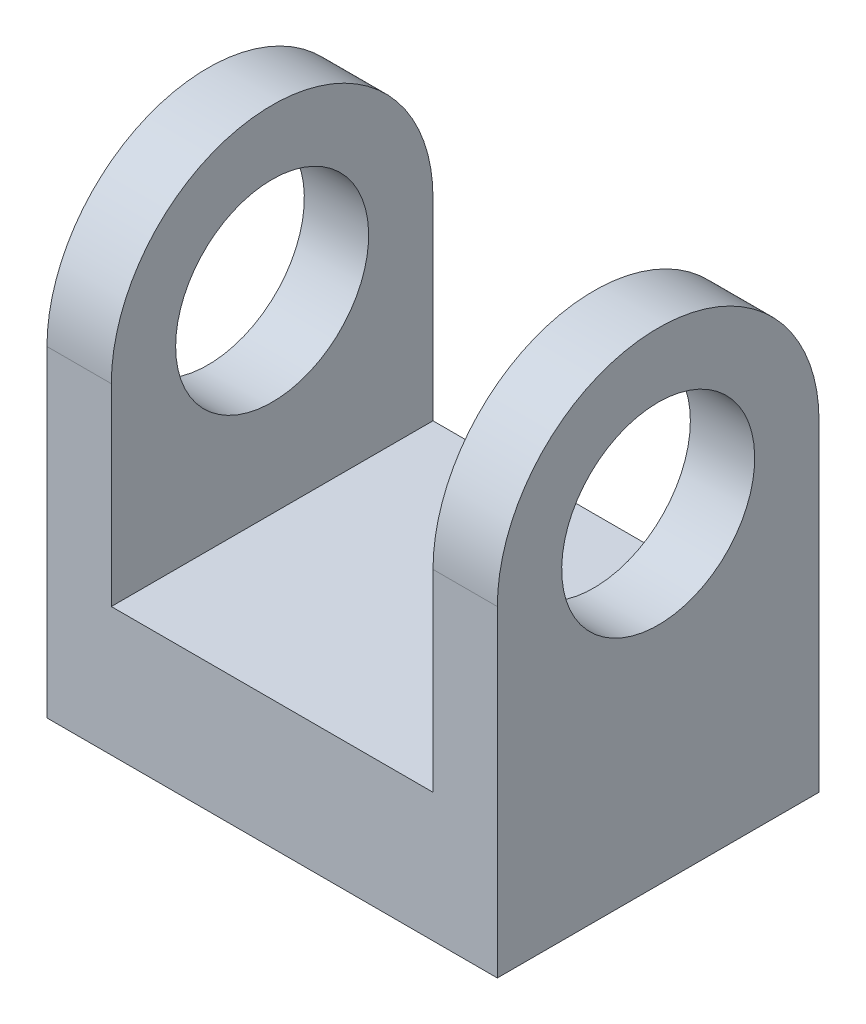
ISO-10303-21;
HEADER;
FILE_DESCRIPTION(('STEP AP214'),'2;1');
FILE_NAME('part.step','',(''),(''),'','','');
FILE_SCHEMA(('AUTOMOTIVE_DESIGN { 1 0 10303 214 1 1 1 1 }'));
ENDSEC;
DATA;
#1=APPLICATION_CONTEXT('core data for automotive mechanical design processes');
#2=APPLICATION_PROTOCOL_DEFINITION('international standard','automotive_design',2000,#1);
#3=PRODUCT_CONTEXT('',#1,'mechanical');
#4=PRODUCT('Part','Part','',(#3));
#5=PRODUCT_RELATED_PRODUCT_CATEGORY('part','',(#4));
#6=PRODUCT_DEFINITION_FORMATION('','',#4);
#7=PRODUCT_DEFINITION_CONTEXT('part definition',#1,'design');
#8=PRODUCT_DEFINITION('design','',#6,#7);
#9=PRODUCT_DEFINITION_SHAPE('','',#8);
#10=(LENGTH_UNIT() NAMED_UNIT(*) SI_UNIT(.MILLI.,.METRE.));
#11=(NAMED_UNIT(*) PLANE_ANGLE_UNIT() SI_UNIT($,.RADIAN.));
#12=(NAMED_UNIT(*) SI_UNIT($,.STERADIAN.) SOLID_ANGLE_UNIT());
#13=UNCERTAINTY_MEASURE_WITH_UNIT(LENGTH_MEASURE(1.E-05),#10,'distance_accuracy_value','');
#14=(GEOMETRIC_REPRESENTATION_CONTEXT(3) GLOBAL_UNCERTAINTY_ASSIGNED_CONTEXT((#13)) GLOBAL_UNIT_ASSIGNED_CONTEXT((#10,
#11,#12)) REPRESENTATION_CONTEXT('',''));
#15=CARTESIAN_POINT('',(0.,0.,0.));
#16=DIRECTION('',(0.,0.,1.));
#17=DIRECTION('',(1.,0.,0.));
#18=AXIS2_PLACEMENT_3D('',#15,#16,#17);
#19=CARTESIAN_POINT('',(-25.,30.,0.));
#20=DIRECTION('',(-1.,0.,0.));
#21=DIRECTION('',(0.,0.,1.));
#22=AXIS2_PLACEMENT_3D('',#19,#20,#21);
#23=CYLINDRICAL_SURFACE('',#22,25.);
#24=DIRECTION('',(-1.,0.,0.));
#25=VECTOR('',#24,1.);
#26=CARTESIAN_POINT('',(-25.,30.,25.));
#27=LINE('',#26,#25);
#28=CARTESIAN_POINT('',(-25.,30.,25.));
#29=VERTEX_POINT('',#28);
#30=CARTESIAN_POINT('',(-35.,30.,25.));
#31=VERTEX_POINT('',#30);
#32=EDGE_CURVE('E160',#29,#31,#27,.T.);
#33=ORIENTED_EDGE('',*,*,#32,.F.);
#34=CARTESIAN_POINT('',(-25.,30.,0.));
#35=DIRECTION('',(-1.,0.,0.));
#36=DIRECTION('',(0.,0.,1.));
#37=AXIS2_PLACEMENT_3D('',#34,#35,#36);
#38=CIRCLE('',#37,25.);
#39=CARTESIAN_POINT('',(-25.,30.,-25.));
#40=VERTEX_POINT('',#39);
#41=EDGE_CURVE('E41',#40,#29,#38,.F.);
#42=ORIENTED_EDGE('',*,*,#41,.F.);
#43=DIRECTION('',(1.,0.,0.));
#44=VECTOR('',#43,1.);
#45=CARTESIAN_POINT('',(-25.,30.,-25.));
#46=LINE('',#45,#44);
#47=CARTESIAN_POINT('',(-35.,30.,-25.));
#48=VERTEX_POINT('',#47);
#49=EDGE_CURVE('E120',#48,#40,#46,.T.);
#50=ORIENTED_EDGE('',*,*,#49,.F.);
#51=CARTESIAN_POINT('',(-35.,30.,0.));
#52=DIRECTION('',(1.,0.,0.));
#53=DIRECTION('',(0.,1.,0.));
#54=AXIS2_PLACEMENT_3D('',#51,#52,#53);
#55=CIRCLE('',#54,25.);
#56=EDGE_CURVE('E11',#31,#48,#55,.F.);
#57=ORIENTED_EDGE('',*,*,#56,.F.);
#58=EDGE_LOOP('',(#33,#42,#50,#57));
#59=FACE_BOUND('',#58,.T.);
#60=ADVANCED_FACE('F33',(#59),#23,.T.);
#61=CARTESIAN_POINT('',(35.,30.,0.));
#62=DIRECTION('',(-1.,0.,0.));
#63=DIRECTION('',(0.,0.,1.));
#64=AXIS2_PLACEMENT_3D('',#61,#62,#63);
#65=CYLINDRICAL_SURFACE('',#64,25.);
#66=DIRECTION('',(-1.,0.,0.));
#67=VECTOR('',#66,1.);
#68=CARTESIAN_POINT('',(-25.,30.,25.));
#69=LINE('',#68,#67);
#70=CARTESIAN_POINT('',(35.,30.,25.));
#71=VERTEX_POINT('',#70);
#72=CARTESIAN_POINT('',(25.,30.,25.));
#73=VERTEX_POINT('',#72);
#74=EDGE_CURVE('E115',#71,#73,#69,.T.);
#75=ORIENTED_EDGE('',*,*,#74,.F.);
#76=CARTESIAN_POINT('',(35.,30.,0.));
#77=DIRECTION('',(-1.,0.,0.));
#78=DIRECTION('',(0.,-1.,0.));
#79=AXIS2_PLACEMENT_3D('',#76,#77,#78);
#80=CIRCLE('',#79,25.);
#81=CARTESIAN_POINT('',(35.,30.,-25.));
#82=VERTEX_POINT('',#81);
#83=EDGE_CURVE('E156',#82,#71,#80,.F.);
#84=ORIENTED_EDGE('',*,*,#83,.F.);
#85=DIRECTION('',(1.,0.,0.));
#86=VECTOR('',#85,1.);
#87=CARTESIAN_POINT('',(35.,30.,-25.));
#88=LINE('',#87,#86);
#89=CARTESIAN_POINT('',(25.,30.,-25.));
#90=VERTEX_POINT('',#89);
#91=EDGE_CURVE('E153',#90,#82,#88,.T.);
#92=ORIENTED_EDGE('',*,*,#91,.F.);
#93=CARTESIAN_POINT('',(25.,30.,0.));
#94=DIRECTION('',(1.,0.,0.));
#95=DIRECTION('',(0.,0.,-1.));
#96=AXIS2_PLACEMENT_3D('',#93,#94,#95);
#97=CIRCLE('',#96,25.);
#98=EDGE_CURVE('E158',#73,#90,#97,.F.);
#99=ORIENTED_EDGE('',*,*,#98,.F.);
#100=EDGE_LOOP('',(#75,#84,#92,#99));
#101=FACE_BOUND('',#100,.T.);
#102=ADVANCED_FACE('F195',(#101),#65,.T.);
#103=CARTESIAN_POINT('',(-25.,0.,25.));
#104=DIRECTION('',(0.,-1.,0.));
#105=DIRECTION('',(0.,0.,-1.));
#106=AXIS2_PLACEMENT_3D('',#103,#104,#105);
#107=PLANE('',#106);
#108=DIRECTION('',(-1.,0.,0.));
#109=VECTOR('',#108,1.);
#110=CARTESIAN_POINT('',(-25.,0.,-25.));
#111=LINE('',#110,#109);
#112=CARTESIAN_POINT('',(25.,0.,-25.));
#113=VERTEX_POINT('',#112);
#114=CARTESIAN_POINT('',(-25.,0.,-25.));
#115=VERTEX_POINT('',#114);
#116=EDGE_CURVE('E96',#113,#115,#111,.T.);
#117=ORIENTED_EDGE('',*,*,#116,.T.);
#118=DIRECTION('',(0.,0.,-1.));
#119=VECTOR('',#118,1.);
#120=CARTESIAN_POINT('',(-25.,0.,25.));
#121=LINE('',#120,#119);
#122=CARTESIAN_POINT('',(-25.,0.,25.));
#123=VERTEX_POINT('',#122);
#124=EDGE_CURVE('E100',#123,#115,#121,.T.);
#125=ORIENTED_EDGE('',*,*,#124,.F.);
#126=DIRECTION('',(-1.,0.,0.));
#127=VECTOR('',#126,1.);
#128=CARTESIAN_POINT('',(25.,0.,25.));
#129=LINE('',#128,#127);
#130=CARTESIAN_POINT('',(25.,0.,25.));
#131=VERTEX_POINT('',#130);
#132=EDGE_CURVE('E133',#131,#123,#129,.T.);
#133=ORIENTED_EDGE('',*,*,#132,.F.);
#134=DIRECTION('',(0.,0.,-1.));
#135=VECTOR('',#134,1.);
#136=CARTESIAN_POINT('',(25.,0.,25.));
#137=LINE('',#136,#135);
#138=EDGE_CURVE('E103',#131,#113,#137,.T.);
#139=ORIENTED_EDGE('',*,*,#138,.T.);
#140=EDGE_LOOP('',(#117,#125,#133,#139));
#141=FACE_BOUND('',#140,.T.);
#142=ADVANCED_FACE('F98',(#141),#107,.F.);
#143=CARTESIAN_POINT('',(-25.,0.,25.));
#144=DIRECTION('',(-1.,0.,0.));
#145=DIRECTION('',(0.,0.,1.));
#146=AXIS2_PLACEMENT_3D('',#143,#144,#145);
#147=PLANE('',#146);
#148=CARTESIAN_POINT('',(-25.,30.,0.));
#149=DIRECTION('',(-1.,0.,0.));
#150=DIRECTION('',(0.,0.,1.));
#151=AXIS2_PLACEMENT_3D('',#148,#149,#150);
#152=CIRCLE('',#151,15.);
#153=CARTESIAN_POINT('',(-25.,30.,15.));
#154=VERTEX_POINT('',#153);
#155=EDGE_CURVE('E108',#154,#154,#152,.T.);
#156=ORIENTED_EDGE('',*,*,#155,.T.);
#157=EDGE_LOOP('',(#156));
#158=FACE_BOUND('',#157,.T.);
#159=DIRECTION('',(0.,1.,0.));
#160=VECTOR('',#159,1.);
#161=CARTESIAN_POINT('',(-25.,0.,-25.));
#162=LINE('',#161,#160);
#163=EDGE_CURVE('E107',#115,#40,#162,.T.);
#164=ORIENTED_EDGE('',*,*,#163,.T.);
#165=ORIENTED_EDGE('',*,*,#41,.T.);
#166=DIRECTION('',(0.,1.,0.));
#167=VECTOR('',#166,1.);
#168=CARTESIAN_POINT('',(-25.,0.,25.));
#169=LINE('',#168,#167);
#170=EDGE_CURVE('E114',#123,#29,#169,.T.);
#171=ORIENTED_EDGE('',*,*,#170,.F.);
#172=ORIENTED_EDGE('',*,*,#124,.T.);
#173=EDGE_LOOP('',(#164,#165,#171,#172));
#174=FACE_BOUND('',#173,.T.);
#175=ADVANCED_FACE('F112',(#158,#174),#147,.F.);
#176=CARTESIAN_POINT('',(-35.,55.,25.));
#177=DIRECTION('',(1.,0.,0.));
#178=DIRECTION('',(0.,1.,0.));
#179=AXIS2_PLACEMENT_3D('',#176,#177,#178);
#180=PLANE('',#179);
#181=CARTESIAN_POINT('',(-35.,30.,0.));
#182=DIRECTION('',(1.,0.,0.));
#183=DIRECTION('',(0.,1.,0.));
#184=AXIS2_PLACEMENT_3D('',#181,#182,#183);
#185=CIRCLE('',#184,15.);
#186=CARTESIAN_POINT('',(-35.,45.,0.));
#187=VERTEX_POINT('',#186);
#188=EDGE_CURVE('E286',#187,#187,#185,.T.);
#189=ORIENTED_EDGE('',*,*,#188,.T.);
#190=EDGE_LOOP('',(#189));
#191=FACE_BOUND('',#190,.T.);
#192=DIRECTION('',(0.,-1.,0.));
#193=VECTOR('',#192,1.);
#194=CARTESIAN_POINT('',(-35.,55.,25.));
#195=LINE('',#194,#193);
#196=CARTESIAN_POINT('',(-35.,-20.,25.));
#197=VERTEX_POINT('',#196);
#198=EDGE_CURVE('E136',#31,#197,#195,.T.);
#199=ORIENTED_EDGE('',*,*,#198,.F.);
#200=ORIENTED_EDGE('',*,*,#56,.T.);
#201=DIRECTION('',(0.,-1.,0.));
#202=VECTOR('',#201,1.);
#203=CARTESIAN_POINT('',(-35.,55.,-25.));
#204=LINE('',#203,#202);
#205=CARTESIAN_POINT('',(-35.,-20.,-25.));
#206=VERTEX_POINT('',#205);
#207=EDGE_CURVE('E121',#48,#206,#204,.T.);
#208=ORIENTED_EDGE('',*,*,#207,.T.);
#209=DIRECTION('',(0.,0.,-1.));
#210=VECTOR('',#209,1.);
#211=CARTESIAN_POINT('',(-35.,-20.,25.));
#212=LINE('',#211,#210);
#213=EDGE_CURVE('E116',#197,#206,#212,.T.);
#214=ORIENTED_EDGE('',*,*,#213,.F.);
#215=EDGE_LOOP('',(#199,#200,#208,#214));
#216=FACE_BOUND('',#215,.T.);
#217=ADVANCED_FACE('F182',(#191,#216),#180,.F.);
#218=CARTESIAN_POINT('',(35.,-20.,25.));
#219=DIRECTION('',(0.,1.,0.));
#220=DIRECTION('',(0.,0.,1.));
#221=AXIS2_PLACEMENT_3D('',#218,#219,#220);
#222=PLANE('',#221);
#223=DIRECTION('',(1.,0.,0.));
#224=VECTOR('',#223,1.);
#225=CARTESIAN_POINT('',(35.,-20.,-25.));
#226=LINE('',#225,#224);
#227=CARTESIAN_POINT('',(35.,-20.,-25.));
#228=VERTEX_POINT('',#227);
#229=EDGE_CURVE('E123',#206,#228,#226,.T.);
#230=ORIENTED_EDGE('',*,*,#229,.T.);
#231=DIRECTION('',(0.,0.,-1.));
#232=VECTOR('',#231,1.);
#233=CARTESIAN_POINT('',(35.,-20.,25.));
#234=LINE('',#233,#232);
#235=CARTESIAN_POINT('',(35.,-20.,25.));
#236=VERTEX_POINT('',#235);
#237=EDGE_CURVE('E146',#236,#228,#234,.T.);
#238=ORIENTED_EDGE('',*,*,#237,.F.);
#239=DIRECTION('',(1.,0.,0.));
#240=VECTOR('',#239,1.);
#241=CARTESIAN_POINT('',(35.,-20.,25.));
#242=LINE('',#241,#240);
#243=EDGE_CURVE('E138',#197,#236,#242,.T.);
#244=ORIENTED_EDGE('',*,*,#243,.F.);
#245=ORIENTED_EDGE('',*,*,#213,.T.);
#246=EDGE_LOOP('',(#230,#238,#244,#245));
#247=FACE_BOUND('',#246,.T.);
#248=ADVANCED_FACE('F180',(#247),#222,.F.);
#249=CARTESIAN_POINT('',(35.,55.,25.));
#250=DIRECTION('',(-1.,0.,0.));
#251=DIRECTION('',(0.,-1.,0.));
#252=AXIS2_PLACEMENT_3D('',#249,#250,#251);
#253=PLANE('',#252);
#254=CARTESIAN_POINT('',(35.,30.,0.));
#255=DIRECTION('',(1.,0.,0.));
#256=DIRECTION('',(0.,1.,0.));
#257=AXIS2_PLACEMENT_3D('',#254,#255,#256);
#258=CIRCLE('',#257,15.);
#259=CARTESIAN_POINT('',(35.,45.,0.));
#260=VERTEX_POINT('',#259);
#261=EDGE_CURVE('E292',#260,#260,#258,.T.);
#262=ORIENTED_EDGE('',*,*,#261,.F.);
#263=EDGE_LOOP('',(#262));
#264=FACE_BOUND('',#263,.T.);
#265=DIRECTION('',(0.,1.,0.));
#266=VECTOR('',#265,1.);
#267=CARTESIAN_POINT('',(35.,55.,-25.));
#268=LINE('',#267,#266);
#269=EDGE_CURVE('E128',#228,#82,#268,.T.);
#270=ORIENTED_EDGE('',*,*,#269,.T.);
#271=ORIENTED_EDGE('',*,*,#83,.T.);
#272=DIRECTION('',(0.,1.,0.));
#273=VECTOR('',#272,1.);
#274=CARTESIAN_POINT('',(35.,55.,25.));
#275=LINE('',#274,#273);
#276=EDGE_CURVE('E140',#236,#71,#275,.T.);
#277=ORIENTED_EDGE('',*,*,#276,.F.);
#278=ORIENTED_EDGE('',*,*,#237,.T.);
#279=EDGE_LOOP('',(#270,#271,#277,#278));
#280=FACE_BOUND('',#279,.T.);
#281=ADVANCED_FACE('F175',(#264,#280),#253,.F.);
#282=CARTESIAN_POINT('',(25.,0.,25.));
#283=DIRECTION('',(1.,0.,0.));
#284=DIRECTION('',(0.,0.,-1.));
#285=AXIS2_PLACEMENT_3D('',#282,#283,#284);
#286=PLANE('',#285);
#287=CARTESIAN_POINT('',(25.,30.,0.));
#288=DIRECTION('',(1.,0.,0.));
#289=DIRECTION('',(0.,0.,-1.));
#290=AXIS2_PLACEMENT_3D('',#287,#288,#289);
#291=CIRCLE('',#290,15.);
#292=CARTESIAN_POINT('',(25.,30.,-15.));
#293=VERTEX_POINT('',#292);
#294=EDGE_CURVE('E36',#293,#293,#291,.T.);
#295=ORIENTED_EDGE('',*,*,#294,.T.);
#296=EDGE_LOOP('',(#295));
#297=FACE_BOUND('',#296,.T.);
#298=DIRECTION('',(0.,-1.,0.));
#299=VECTOR('',#298,1.);
#300=CARTESIAN_POINT('',(25.,0.,25.));
#301=LINE('',#300,#299);
#302=EDGE_CURVE('E143',#73,#131,#301,.T.);
#303=ORIENTED_EDGE('',*,*,#302,.F.);
#304=ORIENTED_EDGE('',*,*,#98,.T.);
#305=DIRECTION('',(0.,-1.,0.));
#306=VECTOR('',#305,1.);
#307=CARTESIAN_POINT('',(25.,0.,-25.));
#308=LINE('',#307,#306);
#309=EDGE_CURVE('E131',#90,#113,#308,.T.);
#310=ORIENTED_EDGE('',*,*,#309,.T.);
#311=ORIENTED_EDGE('',*,*,#138,.F.);
#312=EDGE_LOOP('',(#303,#304,#310,#311));
#313=FACE_BOUND('',#312,.T.);
#314=ADVANCED_FACE('F169',(#297,#313),#286,.F.);
#315=CARTESIAN_POINT('',(-25.,0.,25.));
#316=DIRECTION('',(0.,0.,-1.));
#317=DIRECTION('',(-1.,0.,0.));
#318=AXIS2_PLACEMENT_3D('',#315,#316,#317);
#319=PLANE('',#318);
#320=ORIENTED_EDGE('',*,*,#170,.T.);
#321=ORIENTED_EDGE('',*,*,#32,.T.);
#322=ORIENTED_EDGE('',*,*,#198,.T.);
#323=ORIENTED_EDGE('',*,*,#243,.T.);
#324=ORIENTED_EDGE('',*,*,#276,.T.);
#325=ORIENTED_EDGE('',*,*,#74,.T.);
#326=ORIENTED_EDGE('',*,*,#302,.T.);
#327=ORIENTED_EDGE('',*,*,#132,.T.);
#328=EDGE_LOOP('',(#320,#321,#322,#323,#324,#325,#326,#327));
#329=FACE_BOUND('',#328,.T.);
#330=ADVANCED_FACE('F165',(#329),#319,.F.);
#331=CARTESIAN_POINT('',(-25.,0.,-25.));
#332=DIRECTION('',(0.,0.,-1.));
#333=DIRECTION('',(-1.,0.,0.));
#334=AXIS2_PLACEMENT_3D('',#331,#332,#333);
#335=PLANE('',#334);
#336=ORIENTED_EDGE('',*,*,#207,.F.);
#337=ORIENTED_EDGE('',*,*,#49,.T.);
#338=ORIENTED_EDGE('',*,*,#163,.F.);
#339=ORIENTED_EDGE('',*,*,#116,.F.);
#340=ORIENTED_EDGE('',*,*,#309,.F.);
#341=ORIENTED_EDGE('',*,*,#91,.T.);
#342=ORIENTED_EDGE('',*,*,#269,.F.);
#343=ORIENTED_EDGE('',*,*,#229,.F.);
#344=EDGE_LOOP('',(#336,#337,#338,#339,#340,#341,#342,#343));
#345=FACE_BOUND('',#344,.T.);
#346=ADVANCED_FACE('F119',(#345),#335,.T.);
#347=CARTESIAN_POINT('',(-35.,30.,0.));
#348=DIRECTION('',(1.,0.,0.));
#349=DIRECTION('',(0.,1.,0.));
#350=AXIS2_PLACEMENT_3D('',#347,#348,#349);
#351=CYLINDRICAL_SURFACE('',#350,15.);
#352=ORIENTED_EDGE('',*,*,#261,.T.);
#353=EDGE_LOOP('',(#352));
#354=FACE_BOUND('',#353,.T.);
#355=ORIENTED_EDGE('',*,*,#294,.F.);
#356=EDGE_LOOP('',(#355));
#357=FACE_BOUND('',#356,.T.);
#358=ADVANCED_FACE('F245',(#354,#357),#351,.F.);
#359=ORIENTED_EDGE('',*,*,#188,.F.);
#360=EDGE_LOOP('',(#359));
#361=FACE_BOUND('',#360,.T.);
#362=ORIENTED_EDGE('',*,*,#155,.F.);
#363=EDGE_LOOP('',(#362));
#364=FACE_BOUND('',#363,.T.);
#365=ADVANCED_FACE('F250',(#361,#364),#351,.F.);
#366=CLOSED_SHELL('',(#60,#102,#142,#175,#217,#248,#281,#314,#330,#346,#358,#365));
#367=MANIFOLD_SOLID_BREP('B2',#366);
#368=ADVANCED_BREP_SHAPE_REPRESENTATION('',(#18,#367),#14);
#369=SHAPE_DEFINITION_REPRESENTATION(#9,#368);
ENDSEC;
END-ISO-10303-21;
